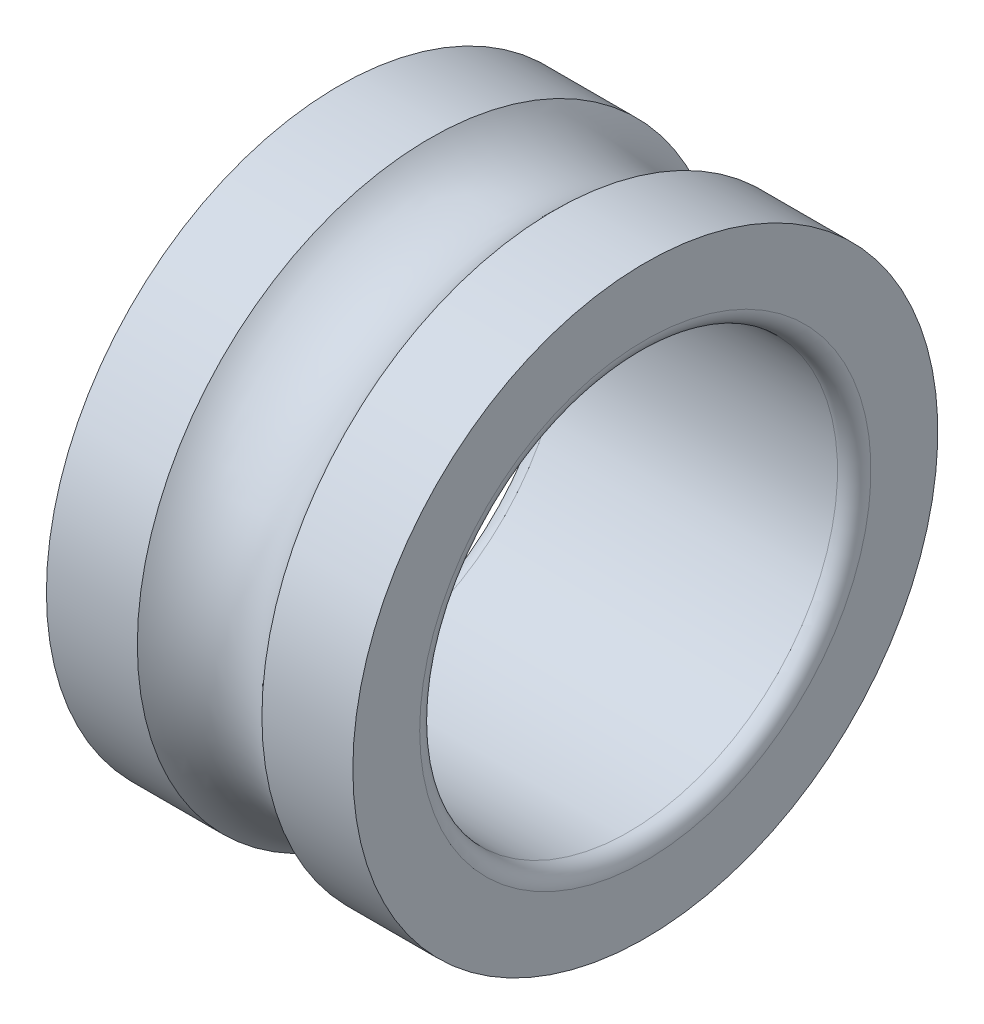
ISO-10303-21;
HEADER;
FILE_DESCRIPTION(('STEP AP214'),'2;1');
FILE_NAME('part.step','',(''),(''),'','','');
FILE_SCHEMA(('AUTOMOTIVE_DESIGN { 1 0 10303 214 1 1 1 1 }'));
ENDSEC;
DATA;
#1=APPLICATION_CONTEXT('core data for automotive mechanical design processes');
#2=APPLICATION_PROTOCOL_DEFINITION('international standard','automotive_design',2000,#1);
#3=PRODUCT_CONTEXT('',#1,'mechanical');
#4=PRODUCT('Part','Part','',(#3));
#5=PRODUCT_RELATED_PRODUCT_CATEGORY('part','',(#4));
#6=PRODUCT_DEFINITION_FORMATION('','',#4);
#7=PRODUCT_DEFINITION_CONTEXT('part definition',#1,'design');
#8=PRODUCT_DEFINITION('design','',#6,#7);
#9=PRODUCT_DEFINITION_SHAPE('','',#8);
#10=(LENGTH_UNIT() NAMED_UNIT(*) SI_UNIT(.MILLI.,.METRE.));
#11=(NAMED_UNIT(*) PLANE_ANGLE_UNIT() SI_UNIT($,.RADIAN.));
#12=(NAMED_UNIT(*) SI_UNIT($,.STERADIAN.) SOLID_ANGLE_UNIT());
#13=UNCERTAINTY_MEASURE_WITH_UNIT(LENGTH_MEASURE(1.E-05),#10,'distance_accuracy_value','');
#14=(GEOMETRIC_REPRESENTATION_CONTEXT(3) GLOBAL_UNCERTAINTY_ASSIGNED_CONTEXT((#13)) GLOBAL_UNIT_ASSIGNED_CONTEXT((#10,
#11,#12)) REPRESENTATION_CONTEXT('',''));
#15=CARTESIAN_POINT('',(0.,0.,0.));
#16=DIRECTION('',(0.,0.,1.));
#17=DIRECTION('',(1.,0.,0.));
#18=AXIS2_PLACEMENT_3D('',#15,#16,#17);
#19=CARTESIAN_POINT('',(0.600000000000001,0.,0.));
#20=DIRECTION('',(-1.,0.,0.));
#21=DIRECTION('',(0.,0.,1.));
#22=AXIS2_PLACEMENT_3D('',#19,#20,#21);
#23=TOROIDAL_SURFACE('',#22,8.1,0.6);
#24=CARTESIAN_POINT('',(0.600000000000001,0.,0.));
#25=DIRECTION('',(-1.,0.,0.));
#26=DIRECTION('',(0.,0.,1.));
#27=AXIS2_PLACEMENT_3D('',#24,#25,#26);
#28=CIRCLE('',#27,7.5);
#29=CARTESIAN_POINT('',(0.600000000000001,0.,7.5));
#30=VERTEX_POINT('',#29);
#31=EDGE_CURVE('E10',#30,#30,#28,.T.);
#32=ORIENTED_EDGE('',*,*,#31,.F.);
#33=EDGE_LOOP('',(#32));
#34=FACE_BOUND('',#33,.T.);
#35=CARTESIAN_POINT('',(0.,0.,0.));
#36=DIRECTION('',(-1.,0.,0.));
#37=DIRECTION('',(0.,0.,1.));
#38=AXIS2_PLACEMENT_3D('',#35,#36,#37);
#39=CIRCLE('',#38,8.1);
#40=CARTESIAN_POINT('',(0.,0.,8.1));
#41=VERTEX_POINT('',#40);
#42=EDGE_CURVE('E52',#41,#41,#39,.T.);
#43=ORIENTED_EDGE('',*,*,#42,.T.);
#44=EDGE_LOOP('',(#43));
#45=FACE_BOUND('',#44,.T.);
#46=ADVANCED_FACE('F24',(#34,#45),#23,.T.);
#47=CARTESIAN_POINT('',(0.,0.,0.));
#48=DIRECTION('',(-1.,0.,0.));
#49=DIRECTION('',(0.,0.,1.));
#50=AXIS2_PLACEMENT_3D('',#47,#48,#49);
#51=CYLINDRICAL_SURFACE('',#50,7.5);
#52=CARTESIAN_POINT('',(10.4,0.,0.));
#53=DIRECTION('',(-1.,0.,0.));
#54=DIRECTION('',(0.,0.,1.));
#55=AXIS2_PLACEMENT_3D('',#52,#53,#54);
#56=CIRCLE('',#55,7.5);
#57=CARTESIAN_POINT('',(10.4,0.,7.5));
#58=VERTEX_POINT('',#57);
#59=EDGE_CURVE('E30',#58,#58,#56,.T.);
#60=ORIENTED_EDGE('',*,*,#59,.F.);
#61=EDGE_LOOP('',(#60));
#62=FACE_BOUND('',#61,.T.);
#63=ORIENTED_EDGE('',*,*,#31,.T.);
#64=EDGE_LOOP('',(#63));
#65=FACE_BOUND('',#64,.T.);
#66=ADVANCED_FACE('F89',(#62,#65),#51,.F.);
#67=CARTESIAN_POINT('',(10.4,0.,0.));
#68=DIRECTION('',(-1.,0.,0.));
#69=DIRECTION('',(0.,0.,1.));
#70=AXIS2_PLACEMENT_3D('',#67,#68,#69);
#71=TOROIDAL_SURFACE('',#70,8.1,0.600000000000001);
#72=CARTESIAN_POINT('',(11.,0.,0.));
#73=DIRECTION('',(-1.,0.,0.));
#74=DIRECTION('',(0.,0.,1.));
#75=AXIS2_PLACEMENT_3D('',#72,#73,#74);
#76=CIRCLE('',#75,8.1);
#77=CARTESIAN_POINT('',(11.,0.,8.1));
#78=VERTEX_POINT('',#77);
#79=EDGE_CURVE('E34',#78,#78,#76,.T.);
#80=ORIENTED_EDGE('',*,*,#79,.F.);
#81=EDGE_LOOP('',(#80));
#82=FACE_BOUND('',#81,.T.);
#83=ORIENTED_EDGE('',*,*,#59,.T.);
#84=EDGE_LOOP('',(#83));
#85=FACE_BOUND('',#84,.T.);
#86=ADVANCED_FACE('F84',(#82,#85),#71,.T.);
#87=CARTESIAN_POINT('',(11.,0.,-10.5));
#88=DIRECTION('',(-1.,0.,0.));
#89=DIRECTION('',(0.,0.,1.));
#90=AXIS2_PLACEMENT_3D('',#87,#88,#89);
#91=PLANE('',#90);
#92=CARTESIAN_POINT('',(11.,0.,0.));
#93=DIRECTION('',(-1.,0.,0.));
#94=DIRECTION('',(0.,0.,1.));
#95=AXIS2_PLACEMENT_3D('',#92,#93,#94);
#96=CIRCLE('',#95,10.5);
#97=CARTESIAN_POINT('',(11.,0.,10.5));
#98=VERTEX_POINT('',#97);
#99=EDGE_CURVE('E38',#98,#98,#96,.T.);
#100=ORIENTED_EDGE('',*,*,#99,.F.);
#101=EDGE_LOOP('',(#100));
#102=FACE_BOUND('',#101,.T.);
#103=ORIENTED_EDGE('',*,*,#79,.T.);
#104=EDGE_LOOP('',(#103));
#105=FACE_BOUND('',#104,.T.);
#106=ADVANCED_FACE('F78',(#102,#105),#91,.F.);
#107=CARTESIAN_POINT('',(0.,0.,0.));
#108=DIRECTION('',(-1.,0.,0.));
#109=DIRECTION('',(0.,0.,1.));
#110=AXIS2_PLACEMENT_3D('',#107,#108,#109);
#111=CYLINDRICAL_SURFACE('',#110,10.5);
#112=CARTESIAN_POINT('',(7.73606797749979,0.,0.));
#113=DIRECTION('',(-1.,0.,0.));
#114=DIRECTION('',(0.,0.,1.));
#115=AXIS2_PLACEMENT_3D('',#112,#113,#114);
#116=CIRCLE('',#115,10.5);
#117=CARTESIAN_POINT('',(7.73606797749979,0.,10.5));
#118=VERTEX_POINT('',#117);
#119=EDGE_CURVE('E43',#118,#118,#116,.T.);
#120=ORIENTED_EDGE('',*,*,#119,.F.);
#121=EDGE_LOOP('',(#120));
#122=FACE_BOUND('',#121,.T.);
#123=ORIENTED_EDGE('',*,*,#99,.T.);
#124=EDGE_LOOP('',(#123));
#125=FACE_BOUND('',#124,.T.);
#126=ADVANCED_FACE('F72',(#122,#125),#111,.T.);
#127=CARTESIAN_POINT('',(5.5,0.,0.));
#128=DIRECTION('',(-1.,0.,0.));
#129=DIRECTION('',(0.,0.,1.));
#130=AXIS2_PLACEMENT_3D('',#127,#128,#129);
#131=TOROIDAL_SURFACE('',#130,12.5,3.);
#132=CARTESIAN_POINT('',(3.26393202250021,0.,0.));
#133=DIRECTION('',(-1.,0.,0.));
#134=DIRECTION('',(0.,0.,1.));
#135=AXIS2_PLACEMENT_3D('',#132,#133,#134);
#136=CIRCLE('',#135,10.5);
#137=CARTESIAN_POINT('',(3.26393202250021,0.,10.5));
#138=VERTEX_POINT('',#137);
#139=EDGE_CURVE('E46',#138,#138,#136,.T.);
#140=ORIENTED_EDGE('',*,*,#139,.F.);
#141=EDGE_LOOP('',(#140));
#142=FACE_BOUND('',#141,.T.);
#143=ORIENTED_EDGE('',*,*,#119,.T.);
#144=EDGE_LOOP('',(#143));
#145=FACE_BOUND('',#144,.T.);
#146=ADVANCED_FACE('F66',(#142,#145),#131,.F.);
#147=CARTESIAN_POINT('',(0.,0.,0.));
#148=DIRECTION('',(-1.,0.,0.));
#149=DIRECTION('',(0.,0.,1.));
#150=AXIS2_PLACEMENT_3D('',#147,#148,#149);
#151=CYLINDRICAL_SURFACE('',#150,10.5);
#152=CARTESIAN_POINT('',(0.,0.,0.));
#153=DIRECTION('',(-1.,0.,0.));
#154=DIRECTION('',(0.,0.,1.));
#155=AXIS2_PLACEMENT_3D('',#152,#153,#154);
#156=CIRCLE('',#155,10.5);
#157=CARTESIAN_POINT('',(0.,0.,10.5));
#158=VERTEX_POINT('',#157);
#159=EDGE_CURVE('E49',#158,#158,#156,.T.);
#160=ORIENTED_EDGE('',*,*,#159,.F.);
#161=EDGE_LOOP('',(#160));
#162=FACE_BOUND('',#161,.T.);
#163=ORIENTED_EDGE('',*,*,#139,.T.);
#164=EDGE_LOOP('',(#163));
#165=FACE_BOUND('',#164,.T.);
#166=ADVANCED_FACE('F60',(#162,#165),#151,.T.);
#167=CARTESIAN_POINT('',(0.,0.,-10.5));
#168=DIRECTION('',(1.,0.,0.));
#169=DIRECTION('',(0.,0.,-1.));
#170=AXIS2_PLACEMENT_3D('',#167,#168,#169);
#171=PLANE('',#170);
#172=ORIENTED_EDGE('',*,*,#42,.F.);
#173=EDGE_LOOP('',(#172));
#174=FACE_BOUND('',#173,.T.);
#175=ORIENTED_EDGE('',*,*,#159,.T.);
#176=EDGE_LOOP('',(#175));
#177=FACE_BOUND('',#176,.T.);
#178=ADVANCED_FACE('F57',(#174,#177),#171,.F.);
#179=CLOSED_SHELL('',(#46,#66,#86,#106,#126,#146,#166,#178));
#180=MANIFOLD_SOLID_BREP('B2',#179);
#181=ADVANCED_BREP_SHAPE_REPRESENTATION('',(#18,#180),#14);
#182=SHAPE_DEFINITION_REPRESENTATION(#9,#181);
ENDSEC;
END-ISO-10303-21;
